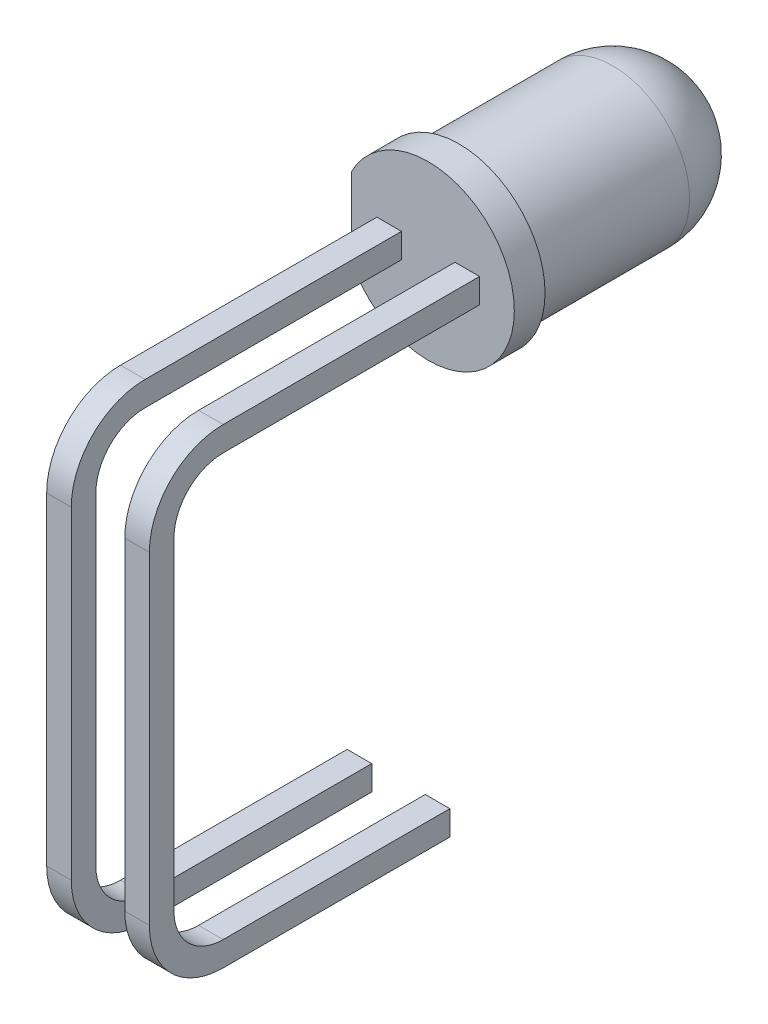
from build123d import *

# Parameters (mm, degrees)
ESQUISSE1_R                = 2.5
BASE_EXTRUSION_DEPTH       = 8.5
BOSS_EXTRU_1_DEPTH         = 1
CONG_1_R                   = 2.5
ESQUISSE7_W                = 0.8
ESQUISSE7_H                = 0.8
R_P_TITION_LIN_AIRE1_COUNT = 2
R_P_TITION_LIN_AIRE1_PITCH = 2.54


with BuildPart() as part:
    # Esquisse1 → Base-Extrusion (new body)
    with BuildSketch(Plane.XY):
        Circle(ESQUISSE1_R)
    extrude(amount=BASE_EXTRUSION_DEPTH)

    # Esquisse2 → Boss.-Extru.1 (add)
    with BuildSketch(Plane.XY.offset(8.5)):
        with BuildLine():
            Line((-2.5, 1.260952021), (-2.5, -1.260952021))
            ThreePointArc((-2.5, -1.260952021), (2.8, 0), (-2.5, 1.260952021))
        make_face()
    extrude(amount=-BOSS_EXTRU_1_DEPTH)

    # Cong_1
    cong_1_edges = [part.edges().sort_by_distance(p)[0] for p in [
        (-2.5, 0, 0),
    ]]
    fillet(cong_1_edges, radius=CONG_1_R)

    # Balayage6: sweep along a path in Esquisse6
    with BuildLine(Plane(origin=(1.27, 0, 0), x_dir=(0, 0, -1), z_dir=(1, 0, 0))) as balayage6_path:
        Line((-8.5, 0), (-16.839962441, 0))
        ThreePointArc((-16.839962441, 0), (-18.254176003, -0.585786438), (-18.839962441, -2))
        Line((-18.839962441, -2), (-18.839962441, -12.507900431))
        ThreePointArc((-18.839962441, -12.507900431), (-18.254176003, -13.922113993), (-16.839962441, -14.507900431))
        Line((-16.839962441, -14.507900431), (-9.466240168, -14.507900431))
    # Esquisse7 → Balayage6 (sweep)
    with BuildSketch(Plane.XY.offset(8.5)):
        with Locations((1.27, 0)):
            Rectangle(ESQUISSE7_W, ESQUISSE7_H)
    balayage6 = sweep(path=balayage6_path.line)

    # R_p_tition lin_aire1: Balayage6 ×2
    with Locations(*[(-i * R_P_TITION_LIN_AIRE1_PITCH, 0, 0) for i in range(1, R_P_TITION_LIN_AIRE1_COUNT)]):
        add(balayage6)


solid = part.part
